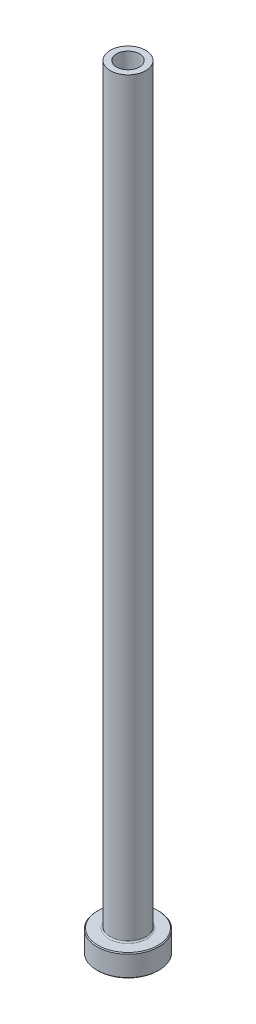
ISO-10303-21;
HEADER;
FILE_DESCRIPTION(('STEP AP214'),'2;1');
FILE_NAME('part.step','',(''),(''),'','','');
FILE_SCHEMA(('AUTOMOTIVE_DESIGN { 1 0 10303 214 1 1 1 1 }'));
ENDSEC;
DATA;
#1=APPLICATION_CONTEXT('core data for automotive mechanical design processes');
#2=APPLICATION_PROTOCOL_DEFINITION('international standard','automotive_design',2000,#1);
#3=PRODUCT_CONTEXT('',#1,'mechanical');
#4=PRODUCT('Part','Part','',(#3));
#5=PRODUCT_RELATED_PRODUCT_CATEGORY('part','',(#4));
#6=PRODUCT_DEFINITION_FORMATION('','',#4);
#7=PRODUCT_DEFINITION_CONTEXT('part definition',#1,'design');
#8=PRODUCT_DEFINITION('design','',#6,#7);
#9=PRODUCT_DEFINITION_SHAPE('','',#8);
#10=(LENGTH_UNIT() NAMED_UNIT(*) SI_UNIT(.MILLI.,.METRE.));
#11=(NAMED_UNIT(*) PLANE_ANGLE_UNIT() SI_UNIT($,.RADIAN.));
#12=(NAMED_UNIT(*) SI_UNIT($,.STERADIAN.) SOLID_ANGLE_UNIT());
#13=UNCERTAINTY_MEASURE_WITH_UNIT(LENGTH_MEASURE(1.E-05),#10,'distance_accuracy_value','');
#14=(GEOMETRIC_REPRESENTATION_CONTEXT(3) GLOBAL_UNCERTAINTY_ASSIGNED_CONTEXT((#13)) GLOBAL_UNIT_ASSIGNED_CONTEXT((#10,
#11,#12)) REPRESENTATION_CONTEXT('',''));
#15=CARTESIAN_POINT('',(0.,0.,0.));
#16=DIRECTION('',(0.,0.,1.));
#17=DIRECTION('',(1.,0.,0.));
#18=AXIS2_PLACEMENT_3D('',#15,#16,#17);
#19=CARTESIAN_POINT('',(0.,92.1876809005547,0.));
#20=DIRECTION('',(0.,1.,0.));
#21=DIRECTION('',(0.,0.,1.));
#22=AXIS2_PLACEMENT_3D('',#19,#20,#21);
#23=CYLINDRICAL_SURFACE('',#22,2.6);
#24=CARTESIAN_POINT('',(0.,175.,0.));
#25=DIRECTION('',(0.,1.,0.));
#26=DIRECTION('',(0.,0.,1.));
#27=AXIS2_PLACEMENT_3D('',#24,#25,#26);
#28=CIRCLE('',#27,2.6);
#29=CARTESIAN_POINT('',(0.,175.,2.6));
#30=VERTEX_POINT('',#29);
#31=EDGE_CURVE('E62',#30,#30,#28,.T.);
#32=ORIENTED_EDGE('',*,*,#31,.T.);
#33=EDGE_LOOP('',(#32));
#34=FACE_BOUND('',#33,.T.);
#35=CARTESIAN_POINT('',(0.,130.,0.));
#36=DIRECTION('',(0.,1.,0.));
#37=DIRECTION('',(0.,0.,1.));
#38=AXIS2_PLACEMENT_3D('',#35,#36,#37);
#39=CIRCLE('',#38,2.6);
#40=CARTESIAN_POINT('',(0.,130.,2.6));
#41=VERTEX_POINT('',#40);
#42=EDGE_CURVE('E71',#41,#41,#39,.T.);
#43=ORIENTED_EDGE('',*,*,#42,.F.);
#44=EDGE_LOOP('',(#43));
#45=FACE_BOUND('',#44,.T.);
#46=ADVANCED_FACE('F30',(#34,#45),#23,.F.);
#47=CARTESIAN_POINT('',(-2.6,175.,0.));
#48=DIRECTION('',(0.,1.,0.));
#49=DIRECTION('',(0.,0.,1.));
#50=AXIS2_PLACEMENT_3D('',#47,#48,#49);
#51=PLANE('',#50);
#52=CARTESIAN_POINT('',(0.,175.,0.));
#53=DIRECTION('',(0.,1.,0.));
#54=DIRECTION('',(0.,0.,1.));
#55=AXIS2_PLACEMENT_3D('',#52,#53,#54);
#56=CIRCLE('',#55,4.00000000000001);
#57=CARTESIAN_POINT('',(0.,175.,4.00000000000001));
#58=VERTEX_POINT('',#57);
#59=EDGE_CURVE('E65',#58,#58,#56,.T.);
#60=ORIENTED_EDGE('',*,*,#59,.T.);
#61=EDGE_LOOP('',(#60));
#62=FACE_BOUND('',#61,.T.);
#63=ORIENTED_EDGE('',*,*,#31,.F.);
#64=EDGE_LOOP('',(#63));
#65=FACE_BOUND('',#64,.T.);
#66=ADVANCED_FACE('F79',(#62,#65),#51,.T.);
#67=CARTESIAN_POINT('',(0.,92.1876809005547,0.));
#68=DIRECTION('',(0.,1.,0.));
#69=DIRECTION('',(0.,0.,1.));
#70=AXIS2_PLACEMENT_3D('',#67,#68,#69);
#71=CYLINDRICAL_SURFACE('',#70,4.);
#72=CARTESIAN_POINT('',(0.,5.3,0.));
#73=DIRECTION('',(0.,1.,0.));
#74=DIRECTION('',(0.,0.,1.));
#75=AXIS2_PLACEMENT_3D('',#72,#73,#74);
#76=CIRCLE('',#75,4.);
#77=CARTESIAN_POINT('',(0.,5.3,4.));
#78=VERTEX_POINT('',#77);
#79=EDGE_CURVE('E59',#78,#78,#76,.T.);
#80=ORIENTED_EDGE('',*,*,#79,.T.);
#81=EDGE_LOOP('',(#80));
#82=FACE_BOUND('',#81,.T.);
#83=ORIENTED_EDGE('',*,*,#59,.F.);
#84=EDGE_LOOP('',(#83));
#85=FACE_BOUND('',#84,.T.);
#86=ADVANCED_FACE('F85',(#82,#85),#71,.T.);
#87=CARTESIAN_POINT('',(-3.99999999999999,5.,0.));
#88=DIRECTION('',(0.,1.,0.));
#89=DIRECTION('',(0.,0.,1.));
#90=AXIS2_PLACEMENT_3D('',#87,#88,#89);
#91=PLANE('',#90);
#92=CARTESIAN_POINT('',(0.,5.,0.));
#93=DIRECTION('',(0.,1.,0.));
#94=DIRECTION('',(0.,0.,1.));
#95=AXIS2_PLACEMENT_3D('',#92,#93,#94);
#96=CIRCLE('',#95,6.79999999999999);
#97=CARTESIAN_POINT('',(0.,5.,6.79999999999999));
#98=VERTEX_POINT('',#97);
#99=EDGE_CURVE('E53',#98,#98,#96,.T.);
#100=ORIENTED_EDGE('',*,*,#99,.T.);
#101=EDGE_LOOP('',(#100));
#102=FACE_BOUND('',#101,.T.);
#103=CARTESIAN_POINT('',(0.,5.,0.));
#104=DIRECTION('',(0.,1.,0.));
#105=DIRECTION('',(0.,0.,1.));
#106=AXIS2_PLACEMENT_3D('',#103,#104,#105);
#107=CIRCLE('',#106,4.3);
#108=CARTESIAN_POINT('',(0.,5.,4.3));
#109=VERTEX_POINT('',#108);
#110=EDGE_CURVE('E56',#109,#109,#107,.F.);
#111=ORIENTED_EDGE('',*,*,#110,.T.);
#112=EDGE_LOOP('',(#111));
#113=FACE_BOUND('',#112,.T.);
#114=ADVANCED_FACE('F111',(#102,#113),#91,.T.);
#115=CARTESIAN_POINT('',(0.,92.1876809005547,0.));
#116=DIRECTION('',(0.,1.,0.));
#117=DIRECTION('',(0.,0.,1.));
#118=AXIS2_PLACEMENT_3D('',#115,#116,#117);
#119=CYLINDRICAL_SURFACE('',#118,6.99999999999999);
#120=CARTESIAN_POINT('',(0.,4.79999999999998,0.));
#121=DIRECTION('',(0.,1.,0.));
#122=DIRECTION('',(0.,0.,1.));
#123=AXIS2_PLACEMENT_3D('',#120,#121,#122);
#124=CIRCLE('',#123,6.99999999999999);
#125=CARTESIAN_POINT('',(0.,4.79999999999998,6.99999999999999));
#126=VERTEX_POINT('',#125);
#127=EDGE_CURVE('E45',#126,#126,#124,.F.);
#128=ORIENTED_EDGE('',*,*,#127,.T.);
#129=EDGE_LOOP('',(#128));
#130=FACE_BOUND('',#129,.T.);
#131=CARTESIAN_POINT('',(0.,0.20000000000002,0.));
#132=DIRECTION('',(0.,-1.,0.));
#133=DIRECTION('',(0.,0.,-1.));
#134=AXIS2_PLACEMENT_3D('',#131,#132,#133);
#135=CIRCLE('',#134,6.99999999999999);
#136=CARTESIAN_POINT('',(0.,0.20000000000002,-6.99999999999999));
#137=VERTEX_POINT('',#136);
#138=EDGE_CURVE('E50',#137,#137,#135,.F.);
#139=ORIENTED_EDGE('',*,*,#138,.T.);
#140=EDGE_LOOP('',(#139));
#141=FACE_BOUND('',#140,.T.);
#142=ADVANCED_FACE('F108',(#130,#141),#119,.T.);
#143=CARTESIAN_POINT('',(-6.99999999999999,0.,0.));
#144=DIRECTION('',(0.,-1.,0.));
#145=DIRECTION('',(0.,0.,-1.));
#146=AXIS2_PLACEMENT_3D('',#143,#144,#145);
#147=PLANE('',#146);
#148=CARTESIAN_POINT('',(0.,0.,0.));
#149=DIRECTION('',(0.,-1.,0.));
#150=DIRECTION('',(0.,0.,-1.));
#151=AXIS2_PLACEMENT_3D('',#148,#149,#150);
#152=CIRCLE('',#151,3.34999999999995);
#153=CARTESIAN_POINT('',(0.,0.,-3.34999999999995));
#154=VERTEX_POINT('',#153);
#155=EDGE_CURVE('E37',#154,#154,#152,.F.);
#156=ORIENTED_EDGE('',*,*,#155,.T.);
#157=EDGE_LOOP('',(#156));
#158=FACE_BOUND('',#157,.T.);
#159=CARTESIAN_POINT('',(0.,0.,0.));
#160=DIRECTION('',(0.,-1.,0.));
#161=DIRECTION('',(0.,0.,-1.));
#162=AXIS2_PLACEMENT_3D('',#159,#160,#161);
#163=CIRCLE('',#162,6.79999999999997);
#164=CARTESIAN_POINT('',(0.,0.,-6.79999999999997));
#165=VERTEX_POINT('',#164);
#166=EDGE_CURVE('E41',#165,#165,#163,.T.);
#167=ORIENTED_EDGE('',*,*,#166,.T.);
#168=EDGE_LOOP('',(#167));
#169=FACE_BOUND('',#168,.T.);
#170=ADVANCED_FACE('F110',(#158,#169),#147,.T.);
#171=CARTESIAN_POINT('',(0.,92.1876809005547,0.));
#172=DIRECTION('',(0.,1.,0.));
#173=DIRECTION('',(0.,0.,1.));
#174=AXIS2_PLACEMENT_3D('',#171,#172,#173);
#175=CYLINDRICAL_SURFACE('',#174,2.85);
#176=CARTESIAN_POINT('',(0.,0.499999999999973,0.));
#177=DIRECTION('',(0.,-1.,0.));
#178=DIRECTION('',(0.,0.,-1.));
#179=AXIS2_PLACEMENT_3D('',#176,#177,#178);
#180=CIRCLE('',#179,2.85);
#181=CARTESIAN_POINT('',(0.,0.499999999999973,-2.85));
#182=VERTEX_POINT('',#181);
#183=EDGE_CURVE('E10',#182,#182,#180,.T.);
#184=ORIENTED_EDGE('',*,*,#183,.T.);
#185=EDGE_LOOP('',(#184));
#186=FACE_BOUND('',#185,.T.);
#187=CARTESIAN_POINT('',(0.,118.,0.));
#188=DIRECTION('',(0.,1.,0.));
#189=DIRECTION('',(0.,0.,1.));
#190=AXIS2_PLACEMENT_3D('',#187,#188,#189);
#191=CIRCLE('',#190,2.85);
#192=CARTESIAN_POINT('',(0.,118.,2.85));
#193=VERTEX_POINT('',#192);
#194=EDGE_CURVE('E68',#193,#193,#191,.T.);
#195=ORIENTED_EDGE('',*,*,#194,.T.);
#196=EDGE_LOOP('',(#195));
#197=FACE_BOUND('',#196,.T.);
#198=ADVANCED_FACE('F118',(#186,#197),#175,.F.);
#199=CARTESIAN_POINT('',(0.,118.,0.));
#200=DIRECTION('',(0.,-1.,0.));
#201=DIRECTION('',(0.,0.,-1.));
#202=AXIS2_PLACEMENT_3D('',#199,#200,#201);
#203=CONICAL_SURFACE('',#202,2.85,0.0208303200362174);
#204=ORIENTED_EDGE('',*,*,#42,.T.);
#205=EDGE_LOOP('',(#204));
#206=FACE_BOUND('',#205,.T.);
#207=ORIENTED_EDGE('',*,*,#194,.F.);
#208=EDGE_LOOP('',(#207));
#209=FACE_BOUND('',#208,.T.);
#210=ADVANCED_FACE('F75',(#206,#209),#203,.F.);
#211=CARTESIAN_POINT('',(0.,5.3,0.));
#212=DIRECTION('',(0.,1.,0.));
#213=DIRECTION('',(0.,0.,1.));
#214=AXIS2_PLACEMENT_3D('',#211,#212,#213);
#215=TOROIDAL_SURFACE('',#214,4.3,0.3);
#216=ORIENTED_EDGE('',*,*,#110,.F.);
#217=EDGE_LOOP('',(#216));
#218=FACE_BOUND('',#217,.T.);
#219=ORIENTED_EDGE('',*,*,#79,.F.);
#220=EDGE_LOOP('',(#219));
#221=FACE_BOUND('',#220,.T.);
#222=ADVANCED_FACE('F90',(#218,#221),#215,.F.);
#223=CARTESIAN_POINT('',(0.,5.,0.));
#224=DIRECTION('',(0.,-1.,0.));
#225=DIRECTION('',(0.,0.,-1.));
#226=AXIS2_PLACEMENT_3D('',#223,#224,#225);
#227=CONICAL_SURFACE('',#226,6.79999999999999,0.785398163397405);
#228=ORIENTED_EDGE('',*,*,#127,.F.);
#229=EDGE_LOOP('',(#228));
#230=FACE_BOUND('',#229,.T.);
#231=ORIENTED_EDGE('',*,*,#99,.F.);
#232=EDGE_LOOP('',(#231));
#233=FACE_BOUND('',#232,.T.);
#234=ADVANCED_FACE('F93',(#230,#233),#227,.T.);
#235=CARTESIAN_POINT('',(0.,0.20000000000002,0.));
#236=DIRECTION('',(0.,1.,0.));
#237=DIRECTION('',(0.,0.,1.));
#238=AXIS2_PLACEMENT_3D('',#235,#236,#237);
#239=CONICAL_SURFACE('',#238,6.99999999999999,0.78539816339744);
#240=ORIENTED_EDGE('',*,*,#166,.F.);
#241=EDGE_LOOP('',(#240));
#242=FACE_BOUND('',#241,.T.);
#243=ORIENTED_EDGE('',*,*,#138,.F.);
#244=EDGE_LOOP('',(#243));
#245=FACE_BOUND('',#244,.T.);
#246=ADVANCED_FACE('F96',(#242,#245),#239,.T.);
#247=CARTESIAN_POINT('',(0.,0.,0.));
#248=DIRECTION('',(0.,-1.,0.));
#249=DIRECTION('',(0.,0.,-1.));
#250=AXIS2_PLACEMENT_3D('',#247,#248,#249);
#251=CONICAL_SURFACE('',#250,3.34999999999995,0.785398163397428);
#252=ORIENTED_EDGE('',*,*,#183,.F.);
#253=EDGE_LOOP('',(#252));
#254=FACE_BOUND('',#253,.T.);
#255=ORIENTED_EDGE('',*,*,#155,.F.);
#256=EDGE_LOOP('',(#255));
#257=FACE_BOUND('',#256,.T.);
#258=ADVANCED_FACE('F32',(#254,#257),#251,.F.);
#259=CLOSED_SHELL('',(#46,#66,#86,#114,#142,#170,#198,#210,#222,#234,#246,#258));
#260=MANIFOLD_SOLID_BREP('B2',#259);
#261=ADVANCED_BREP_SHAPE_REPRESENTATION('',(#18,#260),#14);
#262=SHAPE_DEFINITION_REPRESENTATION(#9,#261);
ENDSEC;
END-ISO-10303-21;
